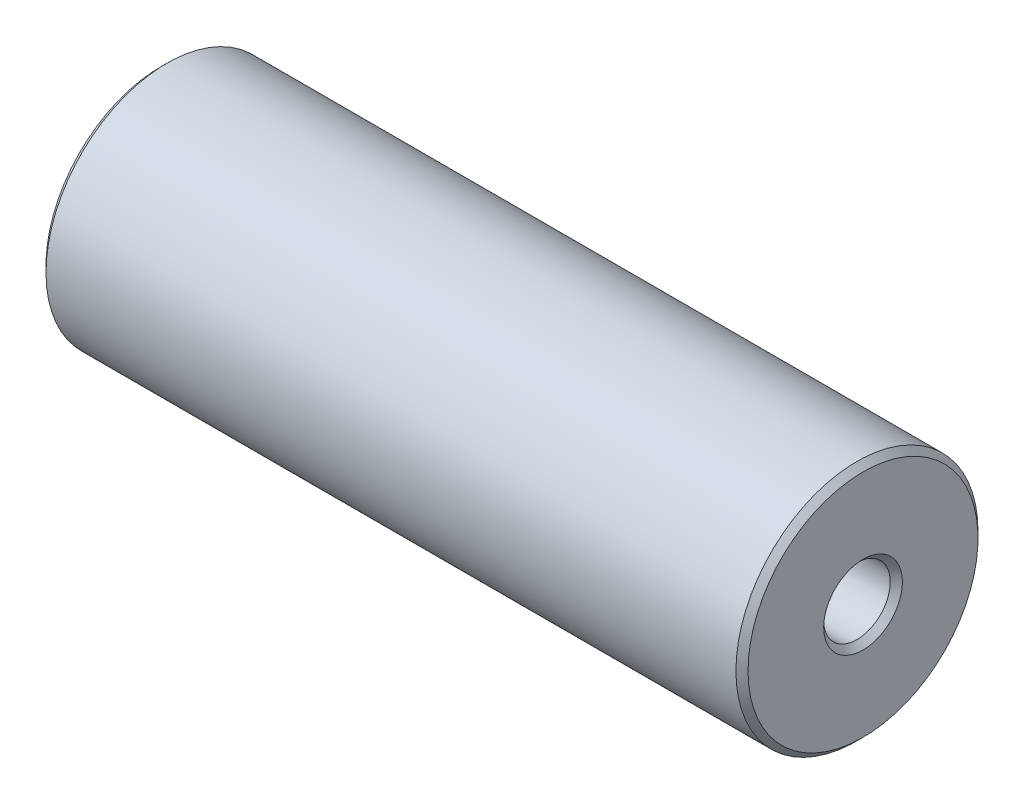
ISO-10303-21;
HEADER;
FILE_DESCRIPTION(('STEP AP214'),'2;1');
FILE_NAME('part.step','',(''),(''),'','','');
FILE_SCHEMA(('AUTOMOTIVE_DESIGN { 1 0 10303 214 1 1 1 1 }'));
ENDSEC;
DATA;
#1=APPLICATION_CONTEXT('core data for automotive mechanical design processes');
#2=APPLICATION_PROTOCOL_DEFINITION('international standard','automotive_design',2000,#1);
#3=PRODUCT_CONTEXT('',#1,'mechanical');
#4=PRODUCT('Part','Part','',(#3));
#5=PRODUCT_RELATED_PRODUCT_CATEGORY('part','',(#4));
#6=PRODUCT_DEFINITION_FORMATION('','',#4);
#7=PRODUCT_DEFINITION_CONTEXT('part definition',#1,'design');
#8=PRODUCT_DEFINITION('design','',#6,#7);
#9=PRODUCT_DEFINITION_SHAPE('','',#8);
#10=(LENGTH_UNIT() NAMED_UNIT(*) SI_UNIT(.MILLI.,.METRE.));
#11=(NAMED_UNIT(*) PLANE_ANGLE_UNIT() SI_UNIT($,.RADIAN.));
#12=(NAMED_UNIT(*) SI_UNIT($,.STERADIAN.) SOLID_ANGLE_UNIT());
#13=UNCERTAINTY_MEASURE_WITH_UNIT(LENGTH_MEASURE(1.E-05),#10,'distance_accuracy_value','');
#14=(GEOMETRIC_REPRESENTATION_CONTEXT(3) GLOBAL_UNCERTAINTY_ASSIGNED_CONTEXT((#13)) GLOBAL_UNIT_ASSIGNED_CONTEXT((#10,
#11,#12)) REPRESENTATION_CONTEXT('',''));
#15=CARTESIAN_POINT('',(0.,0.,0.));
#16=DIRECTION('',(0.,0.,1.));
#17=DIRECTION('',(1.,0.,0.));
#18=AXIS2_PLACEMENT_3D('',#15,#16,#17);
#19=CARTESIAN_POINT('',(0.,0.,0.));
#20=DIRECTION('',(-1.,0.,0.));
#21=DIRECTION('',(0.,0.,1.));
#22=AXIS2_PLACEMENT_3D('',#19,#20,#21);
#23=CYLINDRICAL_SURFACE('',#22,9.);
#24=CARTESIAN_POINT('',(1.,0.,0.));
#25=DIRECTION('',(1.,0.,0.));
#26=DIRECTION('',(0.,0.,-1.));
#27=AXIS2_PLACEMENT_3D('',#24,#25,#26);
#28=CIRCLE('',#27,9.);
#29=CARTESIAN_POINT('',(1.,0.,-9.));
#30=VERTEX_POINT('',#29);
#31=EDGE_CURVE('E25',#30,#30,#28,.F.);
#32=ORIENTED_EDGE('',*,*,#31,.T.);
#33=EDGE_LOOP('',(#32));
#34=FACE_BOUND('',#33,.T.);
#35=CARTESIAN_POINT('',(11.,0.,0.));
#36=DIRECTION('',(-1.,0.,0.));
#37=DIRECTION('',(0.,0.,1.));
#38=AXIS2_PLACEMENT_3D('',#35,#36,#37);
#39=CIRCLE('',#38,9.);
#40=CARTESIAN_POINT('',(11.,0.,9.));
#41=VERTEX_POINT('',#40);
#42=EDGE_CURVE('E49',#41,#41,#39,.T.);
#43=ORIENTED_EDGE('',*,*,#42,.F.);
#44=EDGE_LOOP('',(#43));
#45=FACE_BOUND('',#44,.T.);
#46=ADVANCED_FACE('F14',(#34,#45),#23,.F.);
#47=CARTESIAN_POINT('',(0.,9.,0.));
#48=DIRECTION('',(1.,0.,0.));
#49=DIRECTION('',(0.,0.,-1.));
#50=AXIS2_PLACEMENT_3D('',#47,#48,#49);
#51=PLANE('',#50);
#52=CARTESIAN_POINT('',(0.,0.,0.));
#53=DIRECTION('',(1.,0.,0.));
#54=DIRECTION('',(0.,0.,-1.));
#55=AXIS2_PLACEMENT_3D('',#52,#53,#54);
#56=CIRCLE('',#55,19.);
#57=CARTESIAN_POINT('',(0.,0.,-19.));
#58=VERTEX_POINT('',#57);
#59=EDGE_CURVE('E34',#58,#58,#56,.F.);
#60=ORIENTED_EDGE('',*,*,#59,.T.);
#61=EDGE_LOOP('',(#60));
#62=FACE_BOUND('',#61,.T.);
#63=CARTESIAN_POINT('',(0.,0.,0.));
#64=DIRECTION('',(1.,0.,0.));
#65=DIRECTION('',(0.,0.,-1.));
#66=AXIS2_PLACEMENT_3D('',#63,#64,#65);
#67=CIRCLE('',#66,10.);
#68=CARTESIAN_POINT('',(0.,0.,-10.));
#69=VERTEX_POINT('',#68);
#70=EDGE_CURVE('E37',#69,#69,#67,.T.);
#71=ORIENTED_EDGE('',*,*,#70,.T.);
#72=EDGE_LOOP('',(#71));
#73=FACE_BOUND('',#72,.T.);
#74=ADVANCED_FACE('F56',(#62,#73),#51,.F.);
#75=CARTESIAN_POINT('',(0.,0.,0.));
#76=DIRECTION('',(-1.,0.,0.));
#77=DIRECTION('',(0.,0.,1.));
#78=AXIS2_PLACEMENT_3D('',#75,#76,#77);
#79=CYLINDRICAL_SURFACE('',#78,20.);
#80=CARTESIAN_POINT('',(0.999999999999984,0.,0.));
#81=DIRECTION('',(1.,0.,0.));
#82=DIRECTION('',(0.,0.,-1.));
#83=AXIS2_PLACEMENT_3D('',#80,#81,#82);
#84=CIRCLE('',#83,20.);
#85=CARTESIAN_POINT('',(0.999999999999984,0.,-20.));
#86=VERTEX_POINT('',#85);
#87=EDGE_CURVE('E29',#86,#86,#84,.T.);
#88=ORIENTED_EDGE('',*,*,#87,.T.);
#89=EDGE_LOOP('',(#88));
#90=FACE_BOUND('',#89,.T.);
#91=CARTESIAN_POINT('',(115.,0.,0.));
#92=DIRECTION('',(-1.,0.,0.));
#93=DIRECTION('',(0.,0.,1.));
#94=AXIS2_PLACEMENT_3D('',#91,#92,#93);
#95=CIRCLE('',#94,20.);
#96=CARTESIAN_POINT('',(115.,0.,20.));
#97=VERTEX_POINT('',#96);
#98=EDGE_CURVE('E43',#97,#97,#95,.T.);
#99=ORIENTED_EDGE('',*,*,#98,.T.);
#100=EDGE_LOOP('',(#99));
#101=FACE_BOUND('',#100,.T.);
#102=ADVANCED_FACE('F64',(#90,#101),#79,.T.);
#103=CARTESIAN_POINT('',(116.,20.,0.));
#104=DIRECTION('',(-1.,0.,0.));
#105=DIRECTION('',(0.,0.,1.));
#106=AXIS2_PLACEMENT_3D('',#103,#104,#105);
#107=PLANE('',#106);
#108=CARTESIAN_POINT('',(116.,0.,0.));
#109=DIRECTION('',(-1.,0.,0.));
#110=DIRECTION('',(0.,0.,1.));
#111=AXIS2_PLACEMENT_3D('',#108,#109,#110);
#112=CIRCLE('',#111,6.5);
#113=CARTESIAN_POINT('',(116.,0.,6.5));
#114=VERTEX_POINT('',#113);
#115=EDGE_CURVE('E21',#114,#114,#112,.T.);
#116=ORIENTED_EDGE('',*,*,#115,.T.);
#117=EDGE_LOOP('',(#116));
#118=FACE_BOUND('',#117,.T.);
#119=CARTESIAN_POINT('',(116.,0.,0.));
#120=DIRECTION('',(-1.,0.,0.));
#121=DIRECTION('',(0.,0.,1.));
#122=AXIS2_PLACEMENT_3D('',#119,#120,#121);
#123=CIRCLE('',#122,19.);
#124=CARTESIAN_POINT('',(116.,0.,19.));
#125=VERTEX_POINT('',#124);
#126=EDGE_CURVE('E40',#125,#125,#123,.F.);
#127=ORIENTED_EDGE('',*,*,#126,.T.);
#128=EDGE_LOOP('',(#127));
#129=FACE_BOUND('',#128,.T.);
#130=ADVANCED_FACE('F110',(#118,#129),#107,.F.);
#131=CARTESIAN_POINT('',(0.,0.,0.));
#132=DIRECTION('',(-1.,0.,0.));
#133=DIRECTION('',(0.,0.,1.));
#134=AXIS2_PLACEMENT_3D('',#131,#132,#133);
#135=CYLINDRICAL_SURFACE('',#134,5.5);
#136=CARTESIAN_POINT('',(115.,0.,0.));
#137=DIRECTION('',(-1.,0.,0.));
#138=DIRECTION('',(0.,0.,1.));
#139=AXIS2_PLACEMENT_3D('',#136,#137,#138);
#140=CIRCLE('',#139,5.5);
#141=CARTESIAN_POINT('',(115.,0.,5.5));
#142=VERTEX_POINT('',#141);
#143=EDGE_CURVE('E9',#142,#142,#140,.F.);
#144=ORIENTED_EDGE('',*,*,#143,.T.);
#145=EDGE_LOOP('',(#144));
#146=FACE_BOUND('',#145,.T.);
#147=CARTESIAN_POINT('',(11.,0.,0.));
#148=DIRECTION('',(-1.,0.,0.));
#149=DIRECTION('',(0.,0.,1.));
#150=AXIS2_PLACEMENT_3D('',#147,#148,#149);
#151=CIRCLE('',#150,5.5);
#152=CARTESIAN_POINT('',(11.,0.,5.5));
#153=VERTEX_POINT('',#152);
#154=EDGE_CURVE('E46',#153,#153,#151,.T.);
#155=ORIENTED_EDGE('',*,*,#154,.T.);
#156=EDGE_LOOP('',(#155));
#157=FACE_BOUND('',#156,.T.);
#158=ADVANCED_FACE('F105',(#146,#157),#135,.F.);
#159=CARTESIAN_POINT('',(11.,9.,0.));
#160=DIRECTION('',(1.,0.,0.));
#161=DIRECTION('',(0.,0.,-1.));
#162=AXIS2_PLACEMENT_3D('',#159,#160,#161);
#163=PLANE('',#162);
#164=ORIENTED_EDGE('',*,*,#154,.F.);
#165=EDGE_LOOP('',(#164));
#166=FACE_BOUND('',#165,.T.);
#167=ORIENTED_EDGE('',*,*,#42,.T.);
#168=EDGE_LOOP('',(#167));
#169=FACE_BOUND('',#168,.T.);
#170=ADVANCED_FACE('F53',(#166,#169),#163,.F.);
#171=CARTESIAN_POINT('',(115.,0.,0.));
#172=DIRECTION('',(-1.,0.,0.));
#173=DIRECTION('',(0.,0.,1.));
#174=AXIS2_PLACEMENT_3D('',#171,#172,#173);
#175=CONICAL_SURFACE('',#174,20.,0.785398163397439);
#176=ORIENTED_EDGE('',*,*,#126,.F.);
#177=EDGE_LOOP('',(#176));
#178=FACE_BOUND('',#177,.T.);
#179=ORIENTED_EDGE('',*,*,#98,.F.);
#180=EDGE_LOOP('',(#179));
#181=FACE_BOUND('',#180,.T.);
#182=ADVANCED_FACE('F69',(#178,#181),#175,.T.);
#183=CARTESIAN_POINT('',(0.,0.,0.));
#184=DIRECTION('',(1.,0.,0.));
#185=DIRECTION('',(0.,0.,-1.));
#186=AXIS2_PLACEMENT_3D('',#183,#184,#185);
#187=CONICAL_SURFACE('',#186,19.,0.785398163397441);
#188=ORIENTED_EDGE('',*,*,#87,.F.);
#189=EDGE_LOOP('',(#188));
#190=FACE_BOUND('',#189,.T.);
#191=ORIENTED_EDGE('',*,*,#59,.F.);
#192=EDGE_LOOP('',(#191));
#193=FACE_BOUND('',#192,.T.);
#194=ADVANCED_FACE('F72',(#190,#193),#187,.T.);
#195=CARTESIAN_POINT('',(1.,0.,0.));
#196=DIRECTION('',(-1.,0.,0.));
#197=DIRECTION('',(0.,0.,1.));
#198=AXIS2_PLACEMENT_3D('',#195,#196,#197);
#199=CONICAL_SURFACE('',#198,9.,0.785398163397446);
#200=ORIENTED_EDGE('',*,*,#70,.F.);
#201=EDGE_LOOP('',(#200));
#202=FACE_BOUND('',#201,.T.);
#203=ORIENTED_EDGE('',*,*,#31,.F.);
#204=EDGE_LOOP('',(#203));
#205=FACE_BOUND('',#204,.T.);
#206=ADVANCED_FACE('F75',(#202,#205),#199,.F.);
#207=CARTESIAN_POINT('',(116.,0.,0.));
#208=DIRECTION('',(1.,0.,0.));
#209=DIRECTION('',(0.,0.,-1.));
#210=AXIS2_PLACEMENT_3D('',#207,#208,#209);
#211=CONICAL_SURFACE('',#210,6.5,0.78539816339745);
#212=ORIENTED_EDGE('',*,*,#143,.F.);
#213=EDGE_LOOP('',(#212));
#214=FACE_BOUND('',#213,.T.);
#215=ORIENTED_EDGE('',*,*,#115,.F.);
#216=EDGE_LOOP('',(#215));
#217=FACE_BOUND('',#216,.T.);
#218=ADVANCED_FACE('F16',(#214,#217),#211,.F.);
#219=CLOSED_SHELL('',(#46,#74,#102,#130,#158,#170,#182,#194,#206,#218));
#220=MANIFOLD_SOLID_BREP('B1',#219);
#221=ADVANCED_BREP_SHAPE_REPRESENTATION('',(#18,#220),#14);
#222=SHAPE_DEFINITION_REPRESENTATION(#9,#221);
ENDSEC;
END-ISO-10303-21;
